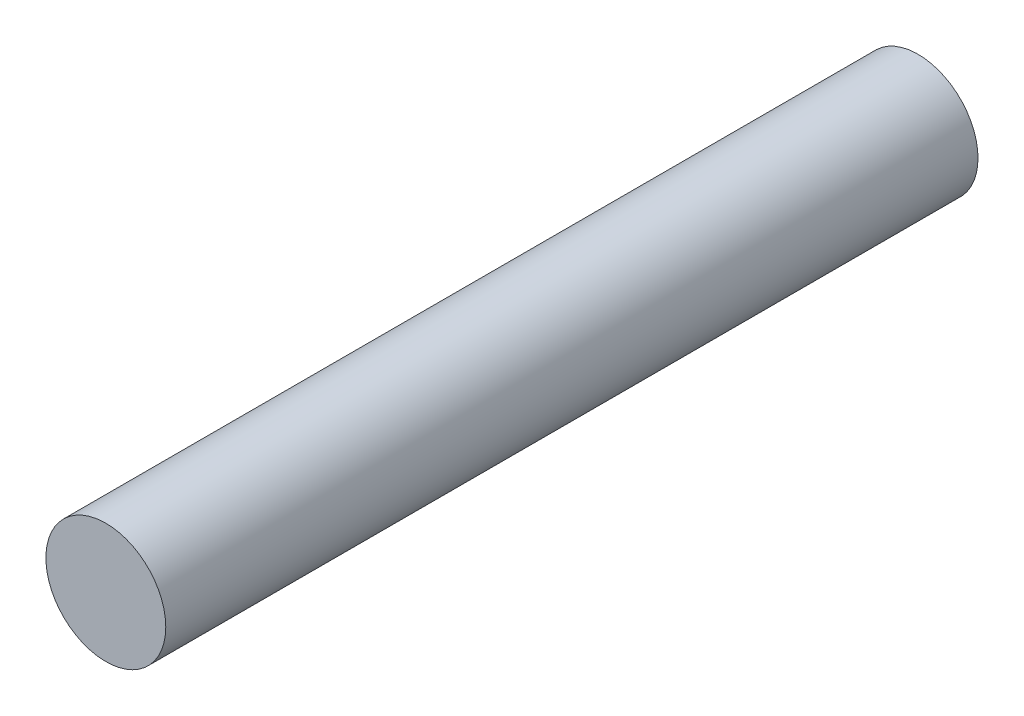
ISO-10303-21;
HEADER;
FILE_DESCRIPTION(('STEP AP214'),'2;1');
FILE_NAME('part.step','',(''),(''),'','','');
FILE_SCHEMA(('AUTOMOTIVE_DESIGN { 1 0 10303 214 1 1 1 1 }'));
ENDSEC;
DATA;
#1=APPLICATION_CONTEXT('core data for automotive mechanical design processes');
#2=APPLICATION_PROTOCOL_DEFINITION('international standard','automotive_design',2000,#1);
#3=PRODUCT_CONTEXT('',#1,'mechanical');
#4=PRODUCT('Part','Part','',(#3));
#5=PRODUCT_RELATED_PRODUCT_CATEGORY('part','',(#4));
#6=PRODUCT_DEFINITION_FORMATION('','',#4);
#7=PRODUCT_DEFINITION_CONTEXT('part definition',#1,'design');
#8=PRODUCT_DEFINITION('design','',#6,#7);
#9=PRODUCT_DEFINITION_SHAPE('','',#8);
#10=(LENGTH_UNIT() NAMED_UNIT(*) SI_UNIT(.MILLI.,.METRE.));
#11=(NAMED_UNIT(*) PLANE_ANGLE_UNIT() SI_UNIT($,.RADIAN.));
#12=(NAMED_UNIT(*) SI_UNIT($,.STERADIAN.) SOLID_ANGLE_UNIT());
#13=UNCERTAINTY_MEASURE_WITH_UNIT(LENGTH_MEASURE(1.E-05),#10,'distance_accuracy_value','');
#14=(GEOMETRIC_REPRESENTATION_CONTEXT(3) GLOBAL_UNCERTAINTY_ASSIGNED_CONTEXT((#13)) GLOBAL_UNIT_ASSIGNED_CONTEXT((#10,
#11,#12)) REPRESENTATION_CONTEXT('',''));
#15=CARTESIAN_POINT('',(0.,0.,0.));
#16=DIRECTION('',(0.,0.,1.));
#17=DIRECTION('',(1.,0.,0.));
#18=AXIS2_PLACEMENT_3D('',#15,#16,#17);
#19=CARTESIAN_POINT('',(0.,0.,250.));
#20=DIRECTION('',(0.,0.,-1.));
#21=DIRECTION('',(-1.,0.,0.));
#22=AXIS2_PLACEMENT_3D('',#19,#20,#21);
#23=CYLINDRICAL_SURFACE('',#22,18.45);
#24=CARTESIAN_POINT('',(0.,0.,250.));
#25=DIRECTION('',(0.,0.,1.));
#26=DIRECTION('',(1.,0.,0.));
#27=AXIS2_PLACEMENT_3D('',#24,#25,#26);
#28=CIRCLE('',#27,18.45);
#29=CARTESIAN_POINT('',(18.45,0.,250.));
#30=VERTEX_POINT('',#29);
#31=EDGE_CURVE('E10',#30,#30,#28,.T.);
#32=ORIENTED_EDGE('',*,*,#31,.F.);
#33=EDGE_LOOP('',(#32));
#34=FACE_BOUND('',#33,.T.);
#35=CARTESIAN_POINT('',(0.,0.,0.));
#36=DIRECTION('',(0.,0.,1.));
#37=DIRECTION('',(1.,0.,0.));
#38=AXIS2_PLACEMENT_3D('',#35,#36,#37);
#39=CIRCLE('',#38,18.45);
#40=CARTESIAN_POINT('',(18.45,0.,0.));
#41=VERTEX_POINT('',#40);
#42=EDGE_CURVE('E38',#41,#41,#39,.T.);
#43=ORIENTED_EDGE('',*,*,#42,.T.);
#44=EDGE_LOOP('',(#43));
#45=FACE_BOUND('',#44,.T.);
#46=ADVANCED_FACE('F35',(#34,#45),#23,.T.);
#47=CARTESIAN_POINT('',(0.,0.,250.));
#48=DIRECTION('',(0.,0.,1.));
#49=DIRECTION('',(1.,0.,0.));
#50=AXIS2_PLACEMENT_3D('',#47,#48,#49);
#51=PLANE('',#50);
#52=ORIENTED_EDGE('',*,*,#31,.T.);
#53=EDGE_LOOP('',(#52));
#54=FACE_BOUND('',#53,.T.);
#55=ADVANCED_FACE('F50',(#54),#51,.T.);
#56=CARTESIAN_POINT('',(0.,0.,0.));
#57=DIRECTION('',(0.,0.,1.));
#58=DIRECTION('',(1.,0.,0.));
#59=AXIS2_PLACEMENT_3D('',#56,#57,#58);
#60=PLANE('',#59);
#61=ORIENTED_EDGE('',*,*,#42,.F.);
#62=EDGE_LOOP('',(#61));
#63=FACE_BOUND('',#62,.T.);
#64=ADVANCED_FACE('F48',(#63),#60,.F.);
#65=CLOSED_SHELL('',(#46,#55,#64));
#66=MANIFOLD_SOLID_BREP('B2',#65);
#67=ADVANCED_BREP_SHAPE_REPRESENTATION('',(#18,#66),#14);
#68=SHAPE_DEFINITION_REPRESENTATION(#9,#67);
ENDSEC;
END-ISO-10303-21;
